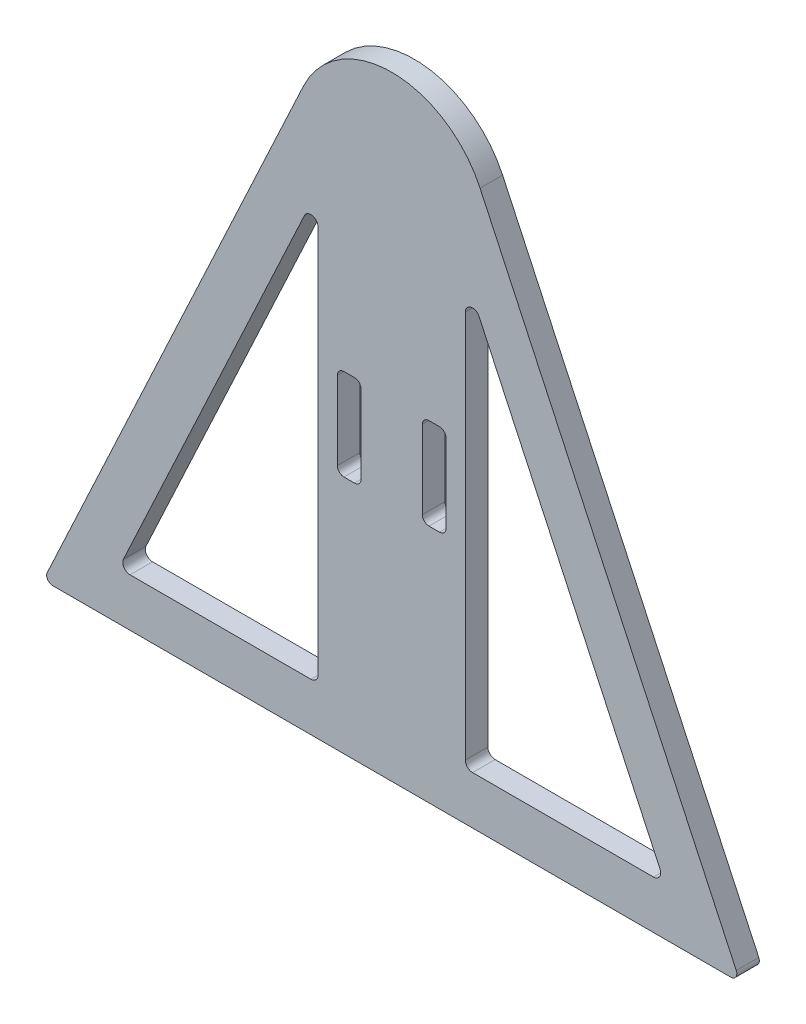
ISO-10303-21;
HEADER;
FILE_DESCRIPTION(('STEP AP214'),'2;1');
FILE_NAME('part.step','',(''),(''),'','','');
FILE_SCHEMA(('AUTOMOTIVE_DESIGN { 1 0 10303 214 1 1 1 1 }'));
ENDSEC;
DATA;
#1=APPLICATION_CONTEXT('core data for automotive mechanical design processes');
#2=APPLICATION_PROTOCOL_DEFINITION('international standard','automotive_design',2000,#1);
#3=PRODUCT_CONTEXT('',#1,'mechanical');
#4=PRODUCT('Part','Part','',(#3));
#5=PRODUCT_RELATED_PRODUCT_CATEGORY('part','',(#4));
#6=PRODUCT_DEFINITION_FORMATION('','',#4);
#7=PRODUCT_DEFINITION_CONTEXT('part definition',#1,'design');
#8=PRODUCT_DEFINITION('design','',#6,#7);
#9=PRODUCT_DEFINITION_SHAPE('','',#8);
#10=(LENGTH_UNIT() NAMED_UNIT(*) SI_UNIT(.MILLI.,.METRE.));
#11=(NAMED_UNIT(*) PLANE_ANGLE_UNIT() SI_UNIT($,.RADIAN.));
#12=(NAMED_UNIT(*) SI_UNIT($,.STERADIAN.) SOLID_ANGLE_UNIT());
#13=UNCERTAINTY_MEASURE_WITH_UNIT(LENGTH_MEASURE(1.E-05),#10,'distance_accuracy_value','');
#14=(GEOMETRIC_REPRESENTATION_CONTEXT(3) GLOBAL_UNCERTAINTY_ASSIGNED_CONTEXT((#13)) GLOBAL_UNIT_ASSIGNED_CONTEXT((#10,
#11,#12)) REPRESENTATION_CONTEXT('',''));
#15=CARTESIAN_POINT('',(0.,0.,0.));
#16=DIRECTION('',(0.,0.,1.));
#17=DIRECTION('',(1.,0.,0.));
#18=AXIS2_PLACEMENT_3D('',#15,#16,#17);
#19=CARTESIAN_POINT('',(-73.66,0.,4.7625));
#20=DIRECTION('',(0.906307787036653,-0.422618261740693,0.));
#21=DIRECTION('',(0.422618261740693,0.906307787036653,0.));
#22=AXIS2_PLACEMENT_3D('',#19,#20,#21);
#23=PLANE('',#22);
#24=DIRECTION('',(-0.422618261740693,-0.906307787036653,0.));
#25=VECTOR('',#24,1.);
#26=CARTESIAN_POINT('',(-73.66,0.,0.));
#27=LINE('',#26,#25);
#28=CARTESIAN_POINT('',(-18.6701806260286,117.926048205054,0.));
#29=VERTEX_POINT('',#28);
#30=CARTESIAN_POINT('',(-72.8175102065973,1.80672519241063,0.));
#31=VERTEX_POINT('',#30);
#32=EDGE_CURVE('E470',#29,#31,#27,.T.);
#33=ORIENTED_EDGE('',*,*,#32,.T.);
#34=DIRECTION('',(0.,0.,-1.));
#35=VECTOR('',#34,1.);
#36=CARTESIAN_POINT('',(-72.8175102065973,1.80672519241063,4.7625));
#37=LINE('',#36,#35);
#38=CARTESIAN_POINT('',(-72.8175102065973,1.80672519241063,4.7625));
#39=VERTEX_POINT('',#38);
#40=EDGE_CURVE('E519',#31,#39,#37,.F.);
#41=ORIENTED_EDGE('',*,*,#40,.T.);
#42=DIRECTION('',(-0.422618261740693,-0.906307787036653,0.));
#43=VECTOR('',#42,1.);
#44=CARTESIAN_POINT('',(-73.66,0.,4.7625));
#45=LINE('',#44,#43);
#46=CARTESIAN_POINT('',(-18.6701806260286,117.926048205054,4.7625));
#47=VERTEX_POINT('',#46);
#48=EDGE_CURVE('E485',#47,#39,#45,.T.);
#49=ORIENTED_EDGE('',*,*,#48,.F.);
#50=DIRECTION('',(0.,0.,-1.));
#51=VECTOR('',#50,1.);
#52=CARTESIAN_POINT('',(-18.6701806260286,117.926048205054,4.7625));
#53=LINE('',#52,#51);
#54=EDGE_CURVE('E496',#47,#29,#53,.T.);
#55=ORIENTED_EDGE('',*,*,#54,.T.);
#56=EDGE_LOOP('',(#33,#41,#49,#55));
#57=FACE_BOUND('',#56,.T.);
#58=ADVANCED_FACE('F35',(#57),#23,.F.);
#59=CARTESIAN_POINT('',(73.66,0.,4.7625));
#60=DIRECTION('',(0.,1.,0.));
#61=DIRECTION('',(-1.,0.,0.));
#62=AXIS2_PLACEMENT_3D('',#59,#60,#61);
#63=PLANE('',#62);
#64=DIRECTION('',(1.,0.,0.));
#65=VECTOR('',#64,1.);
#66=CARTESIAN_POINT('',(73.66,0.,4.7625));
#67=LINE('',#66,#65);
#68=CARTESIAN_POINT('',(-71.6664993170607,0.,4.7625));
#69=VERTEX_POINT('',#68);
#70=CARTESIAN_POINT('',(71.6664993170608,0.,4.7625));
#71=VERTEX_POINT('',#70);
#72=EDGE_CURVE('E488',#69,#71,#67,.T.);
#73=ORIENTED_EDGE('',*,*,#72,.F.);
#74=DIRECTION('',(0.,0.,-1.));
#75=VECTOR('',#74,1.);
#76=CARTESIAN_POINT('',(-71.6664993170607,0.,4.7625));
#77=LINE('',#76,#75);
#78=CARTESIAN_POINT('',(-71.6664993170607,0.,0.));
#79=VERTEX_POINT('',#78);
#80=EDGE_CURVE('E512',#69,#79,#77,.T.);
#81=ORIENTED_EDGE('',*,*,#80,.T.);
#82=DIRECTION('',(1.,0.,0.));
#83=VECTOR('',#82,1.);
#84=CARTESIAN_POINT('',(73.66,0.,0.));
#85=LINE('',#84,#83);
#86=CARTESIAN_POINT('',(71.6664993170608,0.,0.));
#87=VERTEX_POINT('',#86);
#88=EDGE_CURVE('E499',#79,#87,#85,.T.);
#89=ORIENTED_EDGE('',*,*,#88,.T.);
#90=DIRECTION('',(0.,0.,-1.));
#91=VECTOR('',#90,1.);
#92=CARTESIAN_POINT('',(71.6664993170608,0.,4.7625));
#93=LINE('',#92,#91);
#94=EDGE_CURVE('E510',#87,#71,#93,.F.);
#95=ORIENTED_EDGE('',*,*,#94,.T.);
#96=EDGE_LOOP('',(#73,#81,#89,#95));
#97=FACE_BOUND('',#96,.T.);
#98=ADVANCED_FACE('F532',(#97),#63,.F.);
#99=CARTESIAN_POINT('',(73.66,0.,4.7625));
#100=DIRECTION('',(-0.906307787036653,-0.422618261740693,0.));
#101=DIRECTION('',(0.422618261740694,-0.906307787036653,0.));
#102=AXIS2_PLACEMENT_3D('',#99,#100,#101);
#103=PLANE('',#102);
#104=DIRECTION('',(-0.422618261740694,0.906307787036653,0.));
#105=VECTOR('',#104,1.);
#106=CARTESIAN_POINT('',(73.66,0.,4.7625));
#107=LINE('',#106,#105);
#108=CARTESIAN_POINT('',(72.8175102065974,1.80672519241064,4.7625));
#109=VERTEX_POINT('',#108);
#110=CARTESIAN_POINT('',(18.6701806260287,117.926048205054,4.7625));
#111=VERTEX_POINT('',#110);
#112=EDGE_CURVE('E492',#109,#111,#107,.T.);
#113=ORIENTED_EDGE('',*,*,#112,.F.);
#114=DIRECTION('',(0.,0.,-1.));
#115=VECTOR('',#114,1.);
#116=CARTESIAN_POINT('',(72.8175102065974,1.80672519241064,4.7625));
#117=LINE('',#116,#115);
#118=CARTESIAN_POINT('',(72.8175102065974,1.80672519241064,0.));
#119=VERTEX_POINT('',#118);
#120=EDGE_CURVE('E11',#109,#119,#117,.T.);
#121=ORIENTED_EDGE('',*,*,#120,.T.);
#122=DIRECTION('',(-0.422618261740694,0.906307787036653,0.));
#123=VECTOR('',#122,1.);
#124=CARTESIAN_POINT('',(73.66,0.,0.));
#125=LINE('',#124,#123);
#126=CARTESIAN_POINT('',(18.6701806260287,117.926048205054,0.));
#127=VERTEX_POINT('',#126);
#128=EDGE_CURVE('E502',#119,#127,#125,.T.);
#129=ORIENTED_EDGE('',*,*,#128,.T.);
#130=DIRECTION('',(0.,0.,-1.));
#131=VECTOR('',#130,1.);
#132=CARTESIAN_POINT('',(18.6701806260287,117.926048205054,4.7625));
#133=LINE('',#132,#131);
#134=EDGE_CURVE('E507',#111,#127,#133,.T.);
#135=ORIENTED_EDGE('',*,*,#134,.F.);
#136=EDGE_LOOP('',(#113,#121,#129,#135));
#137=FACE_BOUND('',#136,.T.);
#138=ADVANCED_FACE('F548',(#137),#103,.F.);
#139=CARTESIAN_POINT('',(0.,109.22,4.7625));
#140=DIRECTION('',(0.,0.,-1.));
#141=DIRECTION('',(-1.,0.,0.));
#142=AXIS2_PLACEMENT_3D('',#139,#140,#141);
#143=CYLINDRICAL_SURFACE('',#142,20.6002650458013);
#144=CARTESIAN_POINT('',(0.,109.22,0.));
#145=DIRECTION('',(0.,0.,1.));
#146=DIRECTION('',(-1.,0.,0.));
#147=AXIS2_PLACEMENT_3D('',#144,#145,#146);
#148=CIRCLE('',#147,20.6002650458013);
#149=EDGE_CURVE('E489',#127,#29,#148,.T.);
#150=ORIENTED_EDGE('',*,*,#149,.T.);
#151=ORIENTED_EDGE('',*,*,#54,.F.);
#152=CARTESIAN_POINT('',(0.,109.22,4.7625));
#153=DIRECTION('',(0.,0.,1.));
#154=DIRECTION('',(-1.,0.,0.));
#155=AXIS2_PLACEMENT_3D('',#152,#153,#154);
#156=CIRCLE('',#155,20.6002650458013);
#157=EDGE_CURVE('E494',#111,#47,#156,.T.);
#158=ORIENTED_EDGE('',*,*,#157,.F.);
#159=ORIENTED_EDGE('',*,*,#134,.T.);
#160=EDGE_LOOP('',(#150,#151,#158,#159));
#161=FACE_BOUND('',#160,.T.);
#162=ADVANCED_FACE('F543',(#161),#143,.T.);
#163=CARTESIAN_POINT('',(0.,109.22,4.7625));
#164=DIRECTION('',(0.,0.,-1.));
#165=DIRECTION('',(-1.,0.,0.));
#166=AXIS2_PLACEMENT_3D('',#163,#164,#165);
#167=PLANE('',#166);
#168=DIRECTION('',(0.,-1.,0.));
#169=VECTOR('',#168,1.);
#170=CARTESIAN_POINT('',(15.5575,93.686285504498,4.7625));
#171=LINE('',#170,#169);
#172=CARTESIAN_POINT('',(15.5575,93.686285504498,4.7625));
#173=VERTEX_POINT('',#172);
#174=CARTESIAN_POINT('',(15.5575,11.6839999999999,4.7625));
#175=VERTEX_POINT('',#174);
#176=EDGE_CURVE('E289',#173,#175,#171,.T.);
#177=ORIENTED_EDGE('',*,*,#176,.F.);
#178=CARTESIAN_POINT('',(17.0815,93.686285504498,4.7625));
#179=DIRECTION('',(0.,0.,1.));
#180=DIRECTION('',(1.,0.,0.));
#181=AXIS2_PLACEMENT_3D('',#178,#179,#180);
#182=CIRCLE('',#181,1.524);
#183=CARTESIAN_POINT('',(18.4627130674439,94.3303557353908,4.7625));
#184=VERTEX_POINT('',#183);
#185=EDGE_CURVE('E50',#184,#173,#182,.T.);
#186=ORIENTED_EDGE('',*,*,#185,.F.);
#187=DIRECTION('',(-0.422618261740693,0.906307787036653,0.));
#188=VECTOR('',#187,1.);
#189=CARTESIAN_POINT('',(56.7010067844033,12.3280702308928,4.7625));
#190=LINE('',#189,#188);
#191=CARTESIAN_POINT('',(56.7010067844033,12.3280702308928,4.7625));
#192=VERTEX_POINT('',#191);
#193=EDGE_CURVE('E275',#192,#184,#190,.T.);
#194=ORIENTED_EDGE('',*,*,#193,.F.);
#195=CARTESIAN_POINT('',(55.3197937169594,11.6839999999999,4.7625));
#196=DIRECTION('',(0.,0.,1.));
#197=DIRECTION('',(1.,0.,0.));
#198=AXIS2_PLACEMENT_3D('',#195,#196,#197);
#199=CIRCLE('',#198,1.524);
#200=CARTESIAN_POINT('',(55.3197937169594,10.1599999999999,4.7625));
#201=VERTEX_POINT('',#200);
#202=EDGE_CURVE('E278',#201,#192,#199,.T.);
#203=ORIENTED_EDGE('',*,*,#202,.F.);
#204=DIRECTION('',(1.,0.,0.));
#205=VECTOR('',#204,1.);
#206=CARTESIAN_POINT('',(17.0815,10.1599999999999,4.7625));
#207=LINE('',#206,#205);
#208=CARTESIAN_POINT('',(17.0815,10.1599999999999,4.7625));
#209=VERTEX_POINT('',#208);
#210=EDGE_CURVE('E294',#209,#201,#207,.T.);
#211=ORIENTED_EDGE('',*,*,#210,.F.);
#212=CARTESIAN_POINT('',(17.0815,11.6839999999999,4.7625));
#213=DIRECTION('',(0.,0.,1.));
#214=DIRECTION('',(-1.,0.,0.));
#215=AXIS2_PLACEMENT_3D('',#212,#213,#214);
#216=CIRCLE('',#215,1.524);
#217=EDGE_CURVE('E291',#175,#209,#216,.T.);
#218=ORIENTED_EDGE('',*,*,#217,.F.);
#219=EDGE_LOOP('',(#177,#186,#194,#203,#211,#218));
#220=FACE_BOUND('',#219,.T.);
#221=DIRECTION('',(0.,1.,0.));
#222=VECTOR('',#221,1.);
#223=CARTESIAN_POINT('',(-15.5575,93.686285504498,4.7625));
#224=LINE('',#223,#222);
#225=CARTESIAN_POINT('',(-15.5575,11.6839999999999,4.7625));
#226=VERTEX_POINT('',#225);
#227=CARTESIAN_POINT('',(-15.5575,93.686285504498,4.7625));
#228=VERTEX_POINT('',#227);
#229=EDGE_CURVE('E330',#226,#228,#224,.T.);
#230=ORIENTED_EDGE('',*,*,#229,.F.);
#231=CARTESIAN_POINT('',(-17.0815,11.6839999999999,4.7625));
#232=DIRECTION('',(0.,0.,1.));
#233=DIRECTION('',(1.,0.,0.));
#234=AXIS2_PLACEMENT_3D('',#231,#232,#233);
#235=CIRCLE('',#234,1.524);
#236=CARTESIAN_POINT('',(-17.0815,10.1599999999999,4.7625));
#237=VERTEX_POINT('',#236);
#238=EDGE_CURVE('E301',#237,#226,#235,.T.);
#239=ORIENTED_EDGE('',*,*,#238,.F.);
#240=DIRECTION('',(1.,0.,0.));
#241=VECTOR('',#240,1.);
#242=CARTESIAN_POINT('',(-17.0815,10.1599999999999,4.7625));
#243=LINE('',#242,#241);
#244=CARTESIAN_POINT('',(-55.3197937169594,10.1599999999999,4.7625));
#245=VERTEX_POINT('',#244);
#246=EDGE_CURVE('E313',#245,#237,#243,.T.);
#247=ORIENTED_EDGE('',*,*,#246,.F.);
#248=CARTESIAN_POINT('',(-55.3197937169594,11.6839999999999,4.7625));
#249=DIRECTION('',(0.,0.,1.));
#250=DIRECTION('',(-1.,0.,0.));
#251=AXIS2_PLACEMENT_3D('',#248,#249,#250);
#252=CIRCLE('',#251,1.524);
#253=CARTESIAN_POINT('',(-56.7010067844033,12.3280702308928,4.7625));
#254=VERTEX_POINT('',#253);
#255=EDGE_CURVE('E339',#254,#245,#252,.T.);
#256=ORIENTED_EDGE('',*,*,#255,.F.);
#257=DIRECTION('',(-0.422618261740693,-0.906307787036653,0.));
#258=VECTOR('',#257,1.);
#259=CARTESIAN_POINT('',(-56.7010067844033,12.3280702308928,4.7625));
#260=LINE('',#259,#258);
#261=CARTESIAN_POINT('',(-18.4627130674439,94.3303557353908,4.7625));
#262=VERTEX_POINT('',#261);
#263=EDGE_CURVE('E336',#262,#254,#260,.T.);
#264=ORIENTED_EDGE('',*,*,#263,.F.);
#265=CARTESIAN_POINT('',(-17.0815,93.686285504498,4.7625));
#266=DIRECTION('',(0.,0.,1.));
#267=DIRECTION('',(-1.,0.,0.));
#268=AXIS2_PLACEMENT_3D('',#265,#266,#267);
#269=CIRCLE('',#268,1.524);
#270=EDGE_CURVE('E333',#228,#262,#269,.T.);
#271=ORIENTED_EDGE('',*,*,#270,.F.);
#272=EDGE_LOOP('',(#230,#239,#247,#256,#264,#271));
#273=FACE_BOUND('',#272,.T.);
#274=DIRECTION('',(0.,-1.,0.));
#275=VECTOR('',#274,1.);
#276=CARTESIAN_POINT('',(6.47700000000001,68.58,4.7625));
#277=LINE('',#276,#275);
#278=CARTESIAN_POINT('',(6.47700000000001,68.58,4.7625));
#279=VERTEX_POINT('',#278);
#280=CARTESIAN_POINT('',(6.477,52.07,4.7625));
#281=VERTEX_POINT('',#280);
#282=EDGE_CURVE('E384',#279,#281,#277,.T.);
#283=ORIENTED_EDGE('',*,*,#282,.F.);
#284=CARTESIAN_POINT('',(7.874,68.58,4.7625));
#285=DIRECTION('',(0.,0.,1.));
#286=DIRECTION('',(1.,0.,0.));
#287=AXIS2_PLACEMENT_3D('',#284,#285,#286);
#288=CIRCLE('',#287,1.39699999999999);
#289=CARTESIAN_POINT('',(7.874,69.977,4.7625));
#290=VERTEX_POINT('',#289);
#291=EDGE_CURVE('E346',#290,#279,#288,.T.);
#292=ORIENTED_EDGE('',*,*,#291,.F.);
#293=DIRECTION('',(-1.,0.,0.));
#294=VECTOR('',#293,1.);
#295=CARTESIAN_POINT('',(10.0965,69.977,4.7625));
#296=LINE('',#295,#294);
#297=CARTESIAN_POINT('',(10.0965,69.977,4.7625));
#298=VERTEX_POINT('',#297);
#299=EDGE_CURVE('E361',#298,#290,#296,.T.);
#300=ORIENTED_EDGE('',*,*,#299,.F.);
#301=CARTESIAN_POINT('',(10.0965,68.58,4.7625));
#302=DIRECTION('',(0.,0.,1.));
#303=DIRECTION('',(1.,0.,0.));
#304=AXIS2_PLACEMENT_3D('',#301,#302,#303);
#305=CIRCLE('',#304,1.397);
#306=CARTESIAN_POINT('',(11.4935,68.58,4.7625));
#307=VERTEX_POINT('',#306);
#308=EDGE_CURVE('E399',#307,#298,#305,.T.);
#309=ORIENTED_EDGE('',*,*,#308,.F.);
#310=DIRECTION('',(0.,1.,0.));
#311=VECTOR('',#310,1.);
#312=CARTESIAN_POINT('',(11.4935,52.07,4.7625));
#313=LINE('',#312,#311);
#314=CARTESIAN_POINT('',(11.4935,52.07,4.7625));
#315=VERTEX_POINT('',#314);
#316=EDGE_CURVE('E396',#315,#307,#313,.T.);
#317=ORIENTED_EDGE('',*,*,#316,.F.);
#318=CARTESIAN_POINT('',(10.0965,52.07,4.7625));
#319=DIRECTION('',(0.,0.,1.));
#320=DIRECTION('',(1.,0.,0.));
#321=AXIS2_PLACEMENT_3D('',#318,#319,#320);
#322=CIRCLE('',#321,1.397);
#323=CARTESIAN_POINT('',(10.0965,50.673,4.7625));
#324=VERTEX_POINT('',#323);
#325=EDGE_CURVE('E393',#324,#315,#322,.T.);
#326=ORIENTED_EDGE('',*,*,#325,.F.);
#327=DIRECTION('',(1.,0.,0.));
#328=VECTOR('',#327,1.);
#329=CARTESIAN_POINT('',(7.874,50.673,4.7625));
#330=LINE('',#329,#328);
#331=CARTESIAN_POINT('',(7.874,50.673,4.7625));
#332=VERTEX_POINT('',#331);
#333=EDGE_CURVE('E390',#332,#324,#330,.T.);
#334=ORIENTED_EDGE('',*,*,#333,.F.);
#335=CARTESIAN_POINT('',(7.874,52.07,4.7625));
#336=DIRECTION('',(0.,0.,1.));
#337=DIRECTION('',(1.,0.,0.));
#338=AXIS2_PLACEMENT_3D('',#335,#336,#337);
#339=CIRCLE('',#338,1.397);
#340=EDGE_CURVE('E387',#281,#332,#339,.T.);
#341=ORIENTED_EDGE('',*,*,#340,.F.);
#342=EDGE_LOOP('',(#283,#292,#300,#309,#317,#326,#334,#341));
#343=FACE_BOUND('',#342,.T.);
#344=DIRECTION('',(0.,-1.,0.));
#345=VECTOR('',#344,1.);
#346=CARTESIAN_POINT('',(-11.4935,52.07,4.7625));
#347=LINE('',#346,#345);
#348=CARTESIAN_POINT('',(-11.4935,68.58,4.7625));
#349=VERTEX_POINT('',#348);
#350=CARTESIAN_POINT('',(-11.4935,52.07,4.7625));
#351=VERTEX_POINT('',#350);
#352=EDGE_CURVE('E448',#349,#351,#347,.T.);
#353=ORIENTED_EDGE('',*,*,#352,.F.);
#354=CARTESIAN_POINT('',(-10.0965,68.58,4.7625));
#355=DIRECTION('',(0.,0.,1.));
#356=DIRECTION('',(-1.,0.,0.));
#357=AXIS2_PLACEMENT_3D('',#354,#355,#356);
#358=CIRCLE('',#357,1.397);
#359=CARTESIAN_POINT('',(-10.0965,69.977,4.7625));
#360=VERTEX_POINT('',#359);
#361=EDGE_CURVE('E406',#360,#349,#358,.T.);
#362=ORIENTED_EDGE('',*,*,#361,.F.);
#363=DIRECTION('',(-1.,0.,0.));
#364=VECTOR('',#363,1.);
#365=CARTESIAN_POINT('',(-10.0965,69.977,4.7625));
#366=LINE('',#365,#364);
#367=CARTESIAN_POINT('',(-7.874,69.977,4.7625));
#368=VERTEX_POINT('',#367);
#369=EDGE_CURVE('E425',#368,#360,#366,.T.);
#370=ORIENTED_EDGE('',*,*,#369,.F.);
#371=CARTESIAN_POINT('',(-7.874,68.58,4.7625));
#372=DIRECTION('',(0.,0.,1.));
#373=DIRECTION('',(-1.,0.,0.));
#374=AXIS2_PLACEMENT_3D('',#371,#372,#373);
#375=CIRCLE('',#374,1.39699999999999);
#376=CARTESIAN_POINT('',(-6.47700000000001,68.58,4.7625));
#377=VERTEX_POINT('',#376);
#378=EDGE_CURVE('E463',#377,#368,#375,.T.);
#379=ORIENTED_EDGE('',*,*,#378,.F.);
#380=DIRECTION('',(0.,1.,0.));
#381=VECTOR('',#380,1.);
#382=CARTESIAN_POINT('',(-6.47700000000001,68.58,4.7625));
#383=LINE('',#382,#381);
#384=CARTESIAN_POINT('',(-6.477,52.07,4.7625));
#385=VERTEX_POINT('',#384);
#386=EDGE_CURVE('E460',#385,#377,#383,.T.);
#387=ORIENTED_EDGE('',*,*,#386,.F.);
#388=CARTESIAN_POINT('',(-7.874,52.07,4.7625));
#389=DIRECTION('',(0.,0.,1.));
#390=DIRECTION('',(-1.,0.,0.));
#391=AXIS2_PLACEMENT_3D('',#388,#389,#390);
#392=CIRCLE('',#391,1.397);
#393=CARTESIAN_POINT('',(-7.874,50.673,4.7625));
#394=VERTEX_POINT('',#393);
#395=EDGE_CURVE('E457',#394,#385,#392,.T.);
#396=ORIENTED_EDGE('',*,*,#395,.F.);
#397=DIRECTION('',(1.,0.,0.));
#398=VECTOR('',#397,1.);
#399=CARTESIAN_POINT('',(-7.874,50.673,4.7625));
#400=LINE('',#399,#398);
#401=CARTESIAN_POINT('',(-10.0965,50.673,4.7625));
#402=VERTEX_POINT('',#401);
#403=EDGE_CURVE('E454',#402,#394,#400,.T.);
#404=ORIENTED_EDGE('',*,*,#403,.F.);
#405=CARTESIAN_POINT('',(-10.0965,52.07,4.7625));
#406=DIRECTION('',(0.,0.,1.));
#407=DIRECTION('',(-1.,0.,0.));
#408=AXIS2_PLACEMENT_3D('',#405,#406,#407);
#409=CIRCLE('',#408,1.397);
#410=EDGE_CURVE('E451',#351,#402,#409,.T.);
#411=ORIENTED_EDGE('',*,*,#410,.F.);
#412=EDGE_LOOP('',(#353,#362,#370,#379,#387,#396,#404,#411));
#413=FACE_BOUND('',#412,.T.);
#414=ORIENTED_EDGE('',*,*,#48,.T.);
#415=CARTESIAN_POINT('',(-71.6664993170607,1.26999999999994,4.7625));
#416=DIRECTION('',(0.,0.,-1.));
#417=DIRECTION('',(-1.,0.,0.));
#418=AXIS2_PLACEMENT_3D('',#415,#416,#417);
#419=CIRCLE('',#418,1.27);
#420=EDGE_CURVE('E43',#39,#69,#419,.F.);
#421=ORIENTED_EDGE('',*,*,#420,.T.);
#422=ORIENTED_EDGE('',*,*,#72,.T.);
#423=CARTESIAN_POINT('',(71.6664993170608,1.26999999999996,4.7625));
#424=DIRECTION('',(0.,0.,-1.));
#425=DIRECTION('',(-1.,0.,0.));
#426=AXIS2_PLACEMENT_3D('',#423,#424,#425);
#427=CIRCLE('',#426,1.27);
#428=EDGE_CURVE('E521',#71,#109,#427,.F.);
#429=ORIENTED_EDGE('',*,*,#428,.T.);
#430=ORIENTED_EDGE('',*,*,#112,.T.);
#431=ORIENTED_EDGE('',*,*,#157,.T.);
#432=EDGE_LOOP('',(#414,#421,#422,#429,#430,#431));
#433=FACE_BOUND('',#432,.T.);
#434=ADVANCED_FACE('F525',(#220,#273,#343,#413,#433),#167,.F.);
#435=CARTESIAN_POINT('',(0.,109.22,0.));
#436=DIRECTION('',(0.,0.,-1.));
#437=DIRECTION('',(-1.,0.,0.));
#438=AXIS2_PLACEMENT_3D('',#435,#436,#437);
#439=PLANE('',#438);
#440=CARTESIAN_POINT('',(17.0815,93.686285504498,0.));
#441=DIRECTION('',(0.,0.,1.));
#442=DIRECTION('',(1.,0.,0.));
#443=AXIS2_PLACEMENT_3D('',#440,#441,#442);
#444=CIRCLE('',#443,1.524);
#445=CARTESIAN_POINT('',(18.4627130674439,94.3303557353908,0.));
#446=VERTEX_POINT('',#445);
#447=CARTESIAN_POINT('',(15.5575,93.686285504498,0.));
#448=VERTEX_POINT('',#447);
#449=EDGE_CURVE('E258',#446,#448,#444,.T.);
#450=ORIENTED_EDGE('',*,*,#449,.T.);
#451=DIRECTION('',(0.,-1.,0.));
#452=VECTOR('',#451,1.);
#453=CARTESIAN_POINT('',(15.5575,93.686285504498,0.));
#454=LINE('',#453,#452);
#455=CARTESIAN_POINT('',(15.5575,11.6839999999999,0.));
#456=VERTEX_POINT('',#455);
#457=EDGE_CURVE('E267',#448,#456,#454,.T.);
#458=ORIENTED_EDGE('',*,*,#457,.T.);
#459=CARTESIAN_POINT('',(17.0815,11.6839999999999,0.));
#460=DIRECTION('',(0.,0.,1.));
#461=DIRECTION('',(-1.,0.,0.));
#462=AXIS2_PLACEMENT_3D('',#459,#460,#461);
#463=CIRCLE('',#462,1.524);
#464=CARTESIAN_POINT('',(17.0815,10.1599999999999,0.));
#465=VERTEX_POINT('',#464);
#466=EDGE_CURVE('E58',#456,#465,#463,.T.);
#467=ORIENTED_EDGE('',*,*,#466,.T.);
#468=DIRECTION('',(1.,0.,0.));
#469=VECTOR('',#468,1.);
#470=CARTESIAN_POINT('',(17.0815,10.1599999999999,0.));
#471=LINE('',#470,#469);
#472=CARTESIAN_POINT('',(55.3197937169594,10.1599999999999,0.));
#473=VERTEX_POINT('',#472);
#474=EDGE_CURVE('E282',#465,#473,#471,.T.);
#475=ORIENTED_EDGE('',*,*,#474,.T.);
#476=CARTESIAN_POINT('',(55.3197937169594,11.6839999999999,0.));
#477=DIRECTION('',(0.,0.,1.));
#478=DIRECTION('',(1.,0.,0.));
#479=AXIS2_PLACEMENT_3D('',#476,#477,#478);
#480=CIRCLE('',#479,1.524);
#481=CARTESIAN_POINT('',(56.7010067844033,12.3280702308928,0.));
#482=VERTEX_POINT('',#481);
#483=EDGE_CURVE('E285',#473,#482,#480,.T.);
#484=ORIENTED_EDGE('',*,*,#483,.T.);
#485=DIRECTION('',(-0.422618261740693,0.906307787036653,0.));
#486=VECTOR('',#485,1.);
#487=CARTESIAN_POINT('',(56.7010067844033,12.3280702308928,0.));
#488=LINE('',#487,#486);
#489=EDGE_CURVE('E264',#482,#446,#488,.T.);
#490=ORIENTED_EDGE('',*,*,#489,.T.);
#491=EDGE_LOOP('',(#450,#458,#467,#475,#484,#490));
#492=FACE_BOUND('',#491,.T.);
#493=CARTESIAN_POINT('',(-17.0815,11.6839999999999,0.));
#494=DIRECTION('',(0.,0.,1.));
#495=DIRECTION('',(1.,0.,0.));
#496=AXIS2_PLACEMENT_3D('',#493,#494,#495);
#497=CIRCLE('',#496,1.524);
#498=CARTESIAN_POINT('',(-17.0815,10.1599999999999,0.));
#499=VERTEX_POINT('',#498);
#500=CARTESIAN_POINT('',(-15.5575,11.6839999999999,0.));
#501=VERTEX_POINT('',#500);
#502=EDGE_CURVE('E309',#499,#501,#497,.T.);
#503=ORIENTED_EDGE('',*,*,#502,.T.);
#504=DIRECTION('',(0.,1.,0.));
#505=VECTOR('',#504,1.);
#506=CARTESIAN_POINT('',(-15.5575,93.686285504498,0.));
#507=LINE('',#506,#505);
#508=CARTESIAN_POINT('',(-15.5575,93.686285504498,0.));
#509=VERTEX_POINT('',#508);
#510=EDGE_CURVE('E312',#501,#509,#507,.T.);
#511=ORIENTED_EDGE('',*,*,#510,.T.);
#512=CARTESIAN_POINT('',(-17.0815,93.686285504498,0.));
#513=DIRECTION('',(0.,0.,1.));
#514=DIRECTION('',(-1.,0.,0.));
#515=AXIS2_PLACEMENT_3D('',#512,#513,#514);
#516=CIRCLE('',#515,1.524);
#517=CARTESIAN_POINT('',(-18.4627130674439,94.3303557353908,0.));
#518=VERTEX_POINT('',#517);
#519=EDGE_CURVE('E316',#509,#518,#516,.T.);
#520=ORIENTED_EDGE('',*,*,#519,.T.);
#521=DIRECTION('',(-0.422618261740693,-0.906307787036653,0.));
#522=VECTOR('',#521,1.);
#523=CARTESIAN_POINT('',(-56.7010067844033,12.3280702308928,0.));
#524=LINE('',#523,#522);
#525=CARTESIAN_POINT('',(-56.7010067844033,12.3280702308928,0.));
#526=VERTEX_POINT('',#525);
#527=EDGE_CURVE('E319',#518,#526,#524,.T.);
#528=ORIENTED_EDGE('',*,*,#527,.T.);
#529=CARTESIAN_POINT('',(-55.3197937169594,11.6839999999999,0.));
#530=DIRECTION('',(0.,0.,1.));
#531=DIRECTION('',(-1.,0.,0.));
#532=AXIS2_PLACEMENT_3D('',#529,#530,#531);
#533=CIRCLE('',#532,1.524);
#534=CARTESIAN_POINT('',(-55.3197937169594,10.1599999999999,0.));
#535=VERTEX_POINT('',#534);
#536=EDGE_CURVE('E322',#526,#535,#533,.T.);
#537=ORIENTED_EDGE('',*,*,#536,.T.);
#538=DIRECTION('',(1.,0.,0.));
#539=VECTOR('',#538,1.);
#540=CARTESIAN_POINT('',(-17.0815,10.1599999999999,0.));
#541=LINE('',#540,#539);
#542=EDGE_CURVE('E325',#535,#499,#541,.T.);
#543=ORIENTED_EDGE('',*,*,#542,.T.);
#544=EDGE_LOOP('',(#503,#511,#520,#528,#537,#543));
#545=FACE_BOUND('',#544,.T.);
#546=CARTESIAN_POINT('',(7.874,68.58,0.));
#547=DIRECTION('',(0.,0.,1.));
#548=DIRECTION('',(1.,0.,0.));
#549=AXIS2_PLACEMENT_3D('',#546,#547,#548);
#550=CIRCLE('',#549,1.39699999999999);
#551=CARTESIAN_POINT('',(7.874,69.977,0.));
#552=VERTEX_POINT('',#551);
#553=CARTESIAN_POINT('',(6.47700000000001,68.58,0.));
#554=VERTEX_POINT('',#553);
#555=EDGE_CURVE('E357',#552,#554,#550,.T.);
#556=ORIENTED_EDGE('',*,*,#555,.T.);
#557=DIRECTION('',(0.,-1.,0.));
#558=VECTOR('',#557,1.);
#559=CARTESIAN_POINT('',(6.47700000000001,68.58,0.));
#560=LINE('',#559,#558);
#561=CARTESIAN_POINT('',(6.477,52.07,0.));
#562=VERTEX_POINT('',#561);
#563=EDGE_CURVE('E360',#554,#562,#560,.T.);
#564=ORIENTED_EDGE('',*,*,#563,.T.);
#565=CARTESIAN_POINT('',(7.874,52.07,0.));
#566=DIRECTION('',(0.,0.,1.));
#567=DIRECTION('',(1.,0.,0.));
#568=AXIS2_PLACEMENT_3D('',#565,#566,#567);
#569=CIRCLE('',#568,1.397);
#570=CARTESIAN_POINT('',(7.874,50.673,0.));
#571=VERTEX_POINT('',#570);
#572=EDGE_CURVE('E364',#562,#571,#569,.T.);
#573=ORIENTED_EDGE('',*,*,#572,.T.);
#574=DIRECTION('',(1.,0.,0.));
#575=VECTOR('',#574,1.);
#576=CARTESIAN_POINT('',(7.874,50.673,0.));
#577=LINE('',#576,#575);
#578=CARTESIAN_POINT('',(10.0965,50.673,0.));
#579=VERTEX_POINT('',#578);
#580=EDGE_CURVE('E367',#571,#579,#577,.T.);
#581=ORIENTED_EDGE('',*,*,#580,.T.);
#582=CARTESIAN_POINT('',(10.0965,52.07,0.));
#583=DIRECTION('',(0.,0.,1.));
#584=DIRECTION('',(1.,0.,0.));
#585=AXIS2_PLACEMENT_3D('',#582,#583,#584);
#586=CIRCLE('',#585,1.397);
#587=CARTESIAN_POINT('',(11.4935,52.07,0.));
#588=VERTEX_POINT('',#587);
#589=EDGE_CURVE('E370',#579,#588,#586,.T.);
#590=ORIENTED_EDGE('',*,*,#589,.T.);
#591=DIRECTION('',(0.,1.,0.));
#592=VECTOR('',#591,1.);
#593=CARTESIAN_POINT('',(11.4935,52.07,0.));
#594=LINE('',#593,#592);
#595=CARTESIAN_POINT('',(11.4935,68.58,0.));
#596=VERTEX_POINT('',#595);
#597=EDGE_CURVE('E373',#588,#596,#594,.T.);
#598=ORIENTED_EDGE('',*,*,#597,.T.);
#599=CARTESIAN_POINT('',(10.0965,68.58,0.));
#600=DIRECTION('',(0.,0.,1.));
#601=DIRECTION('',(1.,0.,0.));
#602=AXIS2_PLACEMENT_3D('',#599,#600,#601);
#603=CIRCLE('',#602,1.397);
#604=CARTESIAN_POINT('',(10.0965,69.977,0.));
#605=VERTEX_POINT('',#604);
#606=EDGE_CURVE('E376',#596,#605,#603,.T.);
#607=ORIENTED_EDGE('',*,*,#606,.T.);
#608=DIRECTION('',(-1.,0.,0.));
#609=VECTOR('',#608,1.);
#610=CARTESIAN_POINT('',(10.0965,69.977,0.));
#611=LINE('',#610,#609);
#612=EDGE_CURVE('E379',#605,#552,#611,.T.);
#613=ORIENTED_EDGE('',*,*,#612,.T.);
#614=EDGE_LOOP('',(#556,#564,#573,#581,#590,#598,#607,#613));
#615=FACE_BOUND('',#614,.T.);
#616=CARTESIAN_POINT('',(-10.0965,68.58,0.));
#617=DIRECTION('',(0.,0.,1.));
#618=DIRECTION('',(-1.,0.,0.));
#619=AXIS2_PLACEMENT_3D('',#616,#617,#618);
#620=CIRCLE('',#619,1.397);
#621=CARTESIAN_POINT('',(-10.0965,69.977,0.));
#622=VERTEX_POINT('',#621);
#623=CARTESIAN_POINT('',(-11.4935,68.58,0.));
#624=VERTEX_POINT('',#623);
#625=EDGE_CURVE('E421',#622,#624,#620,.T.);
#626=ORIENTED_EDGE('',*,*,#625,.T.);
#627=DIRECTION('',(0.,-1.,0.));
#628=VECTOR('',#627,1.);
#629=CARTESIAN_POINT('',(-11.4935,52.07,0.));
#630=LINE('',#629,#628);
#631=CARTESIAN_POINT('',(-11.4935,52.07,0.));
#632=VERTEX_POINT('',#631);
#633=EDGE_CURVE('E424',#624,#632,#630,.T.);
#634=ORIENTED_EDGE('',*,*,#633,.T.);
#635=CARTESIAN_POINT('',(-10.0965,52.07,0.));
#636=DIRECTION('',(0.,0.,1.));
#637=DIRECTION('',(-1.,0.,0.));
#638=AXIS2_PLACEMENT_3D('',#635,#636,#637);
#639=CIRCLE('',#638,1.397);
#640=CARTESIAN_POINT('',(-10.0965,50.673,0.));
#641=VERTEX_POINT('',#640);
#642=EDGE_CURVE('E428',#632,#641,#639,.T.);
#643=ORIENTED_EDGE('',*,*,#642,.T.);
#644=DIRECTION('',(1.,0.,0.));
#645=VECTOR('',#644,1.);
#646=CARTESIAN_POINT('',(-7.874,50.673,0.));
#647=LINE('',#646,#645);
#648=CARTESIAN_POINT('',(-7.874,50.673,0.));
#649=VERTEX_POINT('',#648);
#650=EDGE_CURVE('E431',#641,#649,#647,.T.);
#651=ORIENTED_EDGE('',*,*,#650,.T.);
#652=CARTESIAN_POINT('',(-7.874,52.07,0.));
#653=DIRECTION('',(0.,0.,1.));
#654=DIRECTION('',(-1.,0.,0.));
#655=AXIS2_PLACEMENT_3D('',#652,#653,#654);
#656=CIRCLE('',#655,1.397);
#657=CARTESIAN_POINT('',(-6.477,52.07,0.));
#658=VERTEX_POINT('',#657);
#659=EDGE_CURVE('E434',#649,#658,#656,.T.);
#660=ORIENTED_EDGE('',*,*,#659,.T.);
#661=DIRECTION('',(0.,1.,0.));
#662=VECTOR('',#661,1.);
#663=CARTESIAN_POINT('',(-6.47700000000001,68.58,0.));
#664=LINE('',#663,#662);
#665=CARTESIAN_POINT('',(-6.47700000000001,68.58,0.));
#666=VERTEX_POINT('',#665);
#667=EDGE_CURVE('E437',#658,#666,#664,.T.);
#668=ORIENTED_EDGE('',*,*,#667,.T.);
#669=CARTESIAN_POINT('',(-7.874,68.58,0.));
#670=DIRECTION('',(0.,0.,1.));
#671=DIRECTION('',(-1.,0.,0.));
#672=AXIS2_PLACEMENT_3D('',#669,#670,#671);
#673=CIRCLE('',#672,1.39699999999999);
#674=CARTESIAN_POINT('',(-7.874,69.977,0.));
#675=VERTEX_POINT('',#674);
#676=EDGE_CURVE('E440',#666,#675,#673,.T.);
#677=ORIENTED_EDGE('',*,*,#676,.T.);
#678=DIRECTION('',(-1.,0.,0.));
#679=VECTOR('',#678,1.);
#680=CARTESIAN_POINT('',(-10.0965,69.977,0.));
#681=LINE('',#680,#679);
#682=EDGE_CURVE('E443',#675,#622,#681,.T.);
#683=ORIENTED_EDGE('',*,*,#682,.T.);
#684=EDGE_LOOP('',(#626,#634,#643,#651,#660,#668,#677,#683));
#685=FACE_BOUND('',#684,.T.);
#686=ORIENTED_EDGE('',*,*,#88,.F.);
#687=CARTESIAN_POINT('',(-71.6664993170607,1.26999999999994,0.));
#688=DIRECTION('',(0.,0.,-1.));
#689=DIRECTION('',(-1.,0.,0.));
#690=AXIS2_PLACEMENT_3D('',#687,#688,#689);
#691=CIRCLE('',#690,1.27);
#692=EDGE_CURVE('E517',#79,#31,#691,.T.);
#693=ORIENTED_EDGE('',*,*,#692,.T.);
#694=ORIENTED_EDGE('',*,*,#32,.F.);
#695=ORIENTED_EDGE('',*,*,#149,.F.);
#696=ORIENTED_EDGE('',*,*,#128,.F.);
#697=CARTESIAN_POINT('',(71.6664993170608,1.26999999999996,0.));
#698=DIRECTION('',(0.,0.,-1.));
#699=DIRECTION('',(-1.,0.,0.));
#700=AXIS2_PLACEMENT_3D('',#697,#698,#699);
#701=CIRCLE('',#700,1.27);
#702=EDGE_CURVE('E515',#119,#87,#701,.T.);
#703=ORIENTED_EDGE('',*,*,#702,.T.);
#704=EDGE_LOOP('',(#686,#693,#694,#695,#696,#703));
#705=FACE_BOUND('',#704,.T.);
#706=ADVANCED_FACE('F271',(#492,#545,#615,#685,#705),#439,.T.);
#707=CARTESIAN_POINT('',(-10.0965,68.58,0.));
#708=DIRECTION('',(0.,0.,1.));
#709=DIRECTION('',(1.,0.,0.));
#710=AXIS2_PLACEMENT_3D('',#707,#708,#709);
#711=CYLINDRICAL_SURFACE('',#710,1.397);
#712=ORIENTED_EDGE('',*,*,#361,.T.);
#713=DIRECTION('',(0.,0.,1.));
#714=VECTOR('',#713,1.);
#715=CARTESIAN_POINT('',(-11.4935,68.58,0.));
#716=LINE('',#715,#714);
#717=EDGE_CURVE('E446',#624,#349,#716,.T.);
#718=ORIENTED_EDGE('',*,*,#717,.F.);
#719=ORIENTED_EDGE('',*,*,#625,.F.);
#720=DIRECTION('',(0.,0.,1.));
#721=VECTOR('',#720,1.);
#722=CARTESIAN_POINT('',(-10.0965,69.977,0.));
#723=LINE('',#722,#721);
#724=EDGE_CURVE('E468',#622,#360,#723,.T.);
#725=ORIENTED_EDGE('',*,*,#724,.T.);
#726=EDGE_LOOP('',(#712,#718,#719,#725));
#727=FACE_BOUND('',#726,.T.);
#728=ADVANCED_FACE('F574',(#727),#711,.F.);
#729=CARTESIAN_POINT('',(-10.0965,69.977,0.));
#730=DIRECTION('',(0.,1.,0.));
#731=DIRECTION('',(0.,0.,1.));
#732=AXIS2_PLACEMENT_3D('',#729,#730,#731);
#733=PLANE('',#732);
#734=ORIENTED_EDGE('',*,*,#369,.T.);
#735=ORIENTED_EDGE('',*,*,#724,.F.);
#736=ORIENTED_EDGE('',*,*,#682,.F.);
#737=DIRECTION('',(0.,0.,1.));
#738=VECTOR('',#737,1.);
#739=CARTESIAN_POINT('',(-7.874,69.977,0.));
#740=LINE('',#739,#738);
#741=EDGE_CURVE('E471',#675,#368,#740,.T.);
#742=ORIENTED_EDGE('',*,*,#741,.T.);
#743=EDGE_LOOP('',(#734,#735,#736,#742));
#744=FACE_BOUND('',#743,.T.);
#745=ADVANCED_FACE('F580',(#744),#733,.F.);
#746=CARTESIAN_POINT('',(-7.874,68.58,0.));
#747=DIRECTION('',(0.,0.,1.));
#748=DIRECTION('',(1.,0.,0.));
#749=AXIS2_PLACEMENT_3D('',#746,#747,#748);
#750=CYLINDRICAL_SURFACE('',#749,1.39699999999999);
#751=ORIENTED_EDGE('',*,*,#378,.T.);
#752=ORIENTED_EDGE('',*,*,#741,.F.);
#753=ORIENTED_EDGE('',*,*,#676,.F.);
#754=DIRECTION('',(0.,0.,1.));
#755=VECTOR('',#754,1.);
#756=CARTESIAN_POINT('',(-6.47700000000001,68.58,0.));
#757=LINE('',#756,#755);
#758=EDGE_CURVE('E473',#666,#377,#757,.T.);
#759=ORIENTED_EDGE('',*,*,#758,.T.);
#760=EDGE_LOOP('',(#751,#752,#753,#759));
#761=FACE_BOUND('',#760,.T.);
#762=ADVANCED_FACE('F602',(#761),#750,.F.);
#763=CARTESIAN_POINT('',(-6.47700000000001,68.58,0.));
#764=DIRECTION('',(1.,0.,0.));
#765=DIRECTION('',(0.,1.,0.));
#766=AXIS2_PLACEMENT_3D('',#763,#764,#765);
#767=PLANE('',#766);
#768=ORIENTED_EDGE('',*,*,#386,.T.);
#769=ORIENTED_EDGE('',*,*,#758,.F.);
#770=ORIENTED_EDGE('',*,*,#667,.F.);
#771=DIRECTION('',(0.,0.,1.));
#772=VECTOR('',#771,1.);
#773=CARTESIAN_POINT('',(-6.477,52.07,0.));
#774=LINE('',#773,#772);
#775=EDGE_CURVE('E475',#658,#385,#774,.T.);
#776=ORIENTED_EDGE('',*,*,#775,.T.);
#777=EDGE_LOOP('',(#768,#769,#770,#776));
#778=FACE_BOUND('',#777,.T.);
#779=ADVANCED_FACE('F598',(#778),#767,.F.);
#780=CARTESIAN_POINT('',(-7.874,52.07,0.));
#781=DIRECTION('',(0.,0.,1.));
#782=DIRECTION('',(1.,0.,0.));
#783=AXIS2_PLACEMENT_3D('',#780,#781,#782);
#784=CYLINDRICAL_SURFACE('',#783,1.397);
#785=ORIENTED_EDGE('',*,*,#395,.T.);
#786=ORIENTED_EDGE('',*,*,#775,.F.);
#787=ORIENTED_EDGE('',*,*,#659,.F.);
#788=DIRECTION('',(0.,0.,1.));
#789=VECTOR('',#788,1.);
#790=CARTESIAN_POINT('',(-7.874,50.673,0.));
#791=LINE('',#790,#789);
#792=EDGE_CURVE('E477',#649,#394,#791,.T.);
#793=ORIENTED_EDGE('',*,*,#792,.T.);
#794=EDGE_LOOP('',(#785,#786,#787,#793));
#795=FACE_BOUND('',#794,.T.);
#796=ADVANCED_FACE('F594',(#795),#784,.F.);
#797=CARTESIAN_POINT('',(-7.874,50.673,0.));
#798=DIRECTION('',(0.,-1.,0.));
#799=DIRECTION('',(0.,0.,-1.));
#800=AXIS2_PLACEMENT_3D('',#797,#798,#799);
#801=PLANE('',#800);
#802=ORIENTED_EDGE('',*,*,#403,.T.);
#803=ORIENTED_EDGE('',*,*,#792,.F.);
#804=ORIENTED_EDGE('',*,*,#650,.F.);
#805=DIRECTION('',(0.,0.,1.));
#806=VECTOR('',#805,1.);
#807=CARTESIAN_POINT('',(-10.0965,50.673,0.));
#808=LINE('',#807,#806);
#809=EDGE_CURVE('E479',#641,#402,#808,.T.);
#810=ORIENTED_EDGE('',*,*,#809,.T.);
#811=EDGE_LOOP('',(#802,#803,#804,#810));
#812=FACE_BOUND('',#811,.T.);
#813=ADVANCED_FACE('F590',(#812),#801,.F.);
#814=CARTESIAN_POINT('',(-10.0965,52.07,0.));
#815=DIRECTION('',(0.,0.,1.));
#816=DIRECTION('',(1.,0.,0.));
#817=AXIS2_PLACEMENT_3D('',#814,#815,#816);
#818=CYLINDRICAL_SURFACE('',#817,1.397);
#819=ORIENTED_EDGE('',*,*,#410,.T.);
#820=ORIENTED_EDGE('',*,*,#809,.F.);
#821=ORIENTED_EDGE('',*,*,#642,.F.);
#822=DIRECTION('',(0.,0.,1.));
#823=VECTOR('',#822,1.);
#824=CARTESIAN_POINT('',(-11.4935,52.07,0.));
#825=LINE('',#824,#823);
#826=EDGE_CURVE('E481',#632,#351,#825,.T.);
#827=ORIENTED_EDGE('',*,*,#826,.T.);
#828=EDGE_LOOP('',(#819,#820,#821,#827));
#829=FACE_BOUND('',#828,.T.);
#830=ADVANCED_FACE('F586',(#829),#818,.F.);
#831=CARTESIAN_POINT('',(-11.4935,52.07,0.));
#832=DIRECTION('',(-1.,0.,0.));
#833=DIRECTION('',(0.,-1.,0.));
#834=AXIS2_PLACEMENT_3D('',#831,#832,#833);
#835=PLANE('',#834);
#836=ORIENTED_EDGE('',*,*,#352,.T.);
#837=ORIENTED_EDGE('',*,*,#826,.F.);
#838=ORIENTED_EDGE('',*,*,#633,.F.);
#839=ORIENTED_EDGE('',*,*,#717,.T.);
#840=EDGE_LOOP('',(#836,#837,#838,#839));
#841=FACE_BOUND('',#840,.T.);
#842=ADVANCED_FACE('F582',(#841),#835,.F.);
#843=CARTESIAN_POINT('',(7.874,68.58,0.));
#844=DIRECTION('',(0.,0.,1.));
#845=DIRECTION('',(1.,0.,0.));
#846=AXIS2_PLACEMENT_3D('',#843,#844,#845);
#847=CYLINDRICAL_SURFACE('',#846,1.39699999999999);
#848=ORIENTED_EDGE('',*,*,#291,.T.);
#849=DIRECTION('',(0.,0.,1.));
#850=VECTOR('',#849,1.);
#851=CARTESIAN_POINT('',(6.47700000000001,68.58,0.));
#852=LINE('',#851,#850);
#853=EDGE_CURVE('E382',#554,#279,#852,.T.);
#854=ORIENTED_EDGE('',*,*,#853,.F.);
#855=ORIENTED_EDGE('',*,*,#555,.F.);
#856=DIRECTION('',(0.,0.,1.));
#857=VECTOR('',#856,1.);
#858=CARTESIAN_POINT('',(7.874,69.977,0.));
#859=LINE('',#858,#857);
#860=EDGE_CURVE('E404',#552,#290,#859,.T.);
#861=ORIENTED_EDGE('',*,*,#860,.T.);
#862=EDGE_LOOP('',(#848,#854,#855,#861));
#863=FACE_BOUND('',#862,.T.);
#864=ADVANCED_FACE('F585',(#863),#847,.F.);
#865=CARTESIAN_POINT('',(10.0965,69.977,0.));
#866=DIRECTION('',(0.,1.,0.));
#867=DIRECTION('',(0.,0.,1.));
#868=AXIS2_PLACEMENT_3D('',#865,#866,#867);
#869=PLANE('',#868);
#870=ORIENTED_EDGE('',*,*,#299,.T.);
#871=ORIENTED_EDGE('',*,*,#860,.F.);
#872=ORIENTED_EDGE('',*,*,#612,.F.);
#873=DIRECTION('',(0.,0.,1.));
#874=VECTOR('',#873,1.);
#875=CARTESIAN_POINT('',(10.0965,69.977,0.));
#876=LINE('',#875,#874);
#877=EDGE_CURVE('E407',#605,#298,#876,.T.);
#878=ORIENTED_EDGE('',*,*,#877,.T.);
#879=EDGE_LOOP('',(#870,#871,#872,#878));
#880=FACE_BOUND('',#879,.T.);
#881=ADVANCED_FACE('F612',(#880),#869,.F.);
#882=CARTESIAN_POINT('',(10.0965,68.58,0.));
#883=DIRECTION('',(0.,0.,1.));
#884=DIRECTION('',(1.,0.,0.));
#885=AXIS2_PLACEMENT_3D('',#882,#883,#884);
#886=CYLINDRICAL_SURFACE('',#885,1.397);
#887=ORIENTED_EDGE('',*,*,#308,.T.);
#888=ORIENTED_EDGE('',*,*,#877,.F.);
#889=ORIENTED_EDGE('',*,*,#606,.F.);
#890=DIRECTION('',(0.,0.,1.));
#891=VECTOR('',#890,1.);
#892=CARTESIAN_POINT('',(11.4935,68.58,0.));
#893=LINE('',#892,#891);
#894=EDGE_CURVE('E409',#596,#307,#893,.T.);
#895=ORIENTED_EDGE('',*,*,#894,.T.);
#896=EDGE_LOOP('',(#887,#888,#889,#895));
#897=FACE_BOUND('',#896,.T.);
#898=ADVANCED_FACE('F632',(#897),#886,.F.);
#899=CARTESIAN_POINT('',(11.4935,52.07,0.));
#900=DIRECTION('',(1.,0.,0.));
#901=DIRECTION('',(0.,1.,0.));
#902=AXIS2_PLACEMENT_3D('',#899,#900,#901);
#903=PLANE('',#902);
#904=ORIENTED_EDGE('',*,*,#316,.T.);
#905=ORIENTED_EDGE('',*,*,#894,.F.);
#906=ORIENTED_EDGE('',*,*,#597,.F.);
#907=DIRECTION('',(0.,0.,1.));
#908=VECTOR('',#907,1.);
#909=CARTESIAN_POINT('',(11.4935,52.07,0.));
#910=LINE('',#909,#908);
#911=EDGE_CURVE('E411',#588,#315,#910,.T.);
#912=ORIENTED_EDGE('',*,*,#911,.T.);
#913=EDGE_LOOP('',(#904,#905,#906,#912));
#914=FACE_BOUND('',#913,.T.);
#915=ADVANCED_FACE('F628',(#914),#903,.F.);
#916=CARTESIAN_POINT('',(10.0965,52.07,0.));
#917=DIRECTION('',(0.,0.,1.));
#918=DIRECTION('',(1.,0.,0.));
#919=AXIS2_PLACEMENT_3D('',#916,#917,#918);
#920=CYLINDRICAL_SURFACE('',#919,1.397);
#921=ORIENTED_EDGE('',*,*,#325,.T.);
#922=ORIENTED_EDGE('',*,*,#911,.F.);
#923=ORIENTED_EDGE('',*,*,#589,.F.);
#924=DIRECTION('',(0.,0.,1.));
#925=VECTOR('',#924,1.);
#926=CARTESIAN_POINT('',(10.0965,50.673,0.));
#927=LINE('',#926,#925);
#928=EDGE_CURVE('E413',#579,#324,#927,.T.);
#929=ORIENTED_EDGE('',*,*,#928,.T.);
#930=EDGE_LOOP('',(#921,#922,#923,#929));
#931=FACE_BOUND('',#930,.T.);
#932=ADVANCED_FACE('F624',(#931),#920,.F.);
#933=CARTESIAN_POINT('',(7.874,50.673,0.));
#934=DIRECTION('',(0.,-1.,0.));
#935=DIRECTION('',(0.,0.,-1.));
#936=AXIS2_PLACEMENT_3D('',#933,#934,#935);
#937=PLANE('',#936);
#938=ORIENTED_EDGE('',*,*,#333,.T.);
#939=ORIENTED_EDGE('',*,*,#928,.F.);
#940=ORIENTED_EDGE('',*,*,#580,.F.);
#941=DIRECTION('',(0.,0.,1.));
#942=VECTOR('',#941,1.);
#943=CARTESIAN_POINT('',(7.874,50.673,0.));
#944=LINE('',#943,#942);
#945=EDGE_CURVE('E415',#571,#332,#944,.T.);
#946=ORIENTED_EDGE('',*,*,#945,.T.);
#947=EDGE_LOOP('',(#938,#939,#940,#946));
#948=FACE_BOUND('',#947,.T.);
#949=ADVANCED_FACE('F620',(#948),#937,.F.);
#950=CARTESIAN_POINT('',(7.874,52.07,0.));
#951=DIRECTION('',(0.,0.,1.));
#952=DIRECTION('',(1.,0.,0.));
#953=AXIS2_PLACEMENT_3D('',#950,#951,#952);
#954=CYLINDRICAL_SURFACE('',#953,1.397);
#955=ORIENTED_EDGE('',*,*,#340,.T.);
#956=ORIENTED_EDGE('',*,*,#945,.F.);
#957=ORIENTED_EDGE('',*,*,#572,.F.);
#958=DIRECTION('',(0.,0.,1.));
#959=VECTOR('',#958,1.);
#960=CARTESIAN_POINT('',(6.477,52.07,0.));
#961=LINE('',#960,#959);
#962=EDGE_CURVE('E417',#562,#281,#961,.T.);
#963=ORIENTED_EDGE('',*,*,#962,.T.);
#964=EDGE_LOOP('',(#955,#956,#957,#963));
#965=FACE_BOUND('',#964,.T.);
#966=ADVANCED_FACE('F616',(#965),#954,.F.);
#967=CARTESIAN_POINT('',(6.47700000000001,68.58,0.));
#968=DIRECTION('',(-1.,0.,0.));
#969=DIRECTION('',(0.,-1.,0.));
#970=AXIS2_PLACEMENT_3D('',#967,#968,#969);
#971=PLANE('',#970);
#972=ORIENTED_EDGE('',*,*,#282,.T.);
#973=ORIENTED_EDGE('',*,*,#962,.F.);
#974=ORIENTED_EDGE('',*,*,#563,.F.);
#975=ORIENTED_EDGE('',*,*,#853,.T.);
#976=EDGE_LOOP('',(#972,#973,#974,#975));
#977=FACE_BOUND('',#976,.T.);
#978=ADVANCED_FACE('F560',(#977),#971,.F.);
#979=CARTESIAN_POINT('',(-71.6664993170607,1.26999999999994,4.7625));
#980=DIRECTION('',(0.,0.,-1.));
#981=DIRECTION('',(-1.,0.,0.));
#982=AXIS2_PLACEMENT_3D('',#979,#980,#981);
#983=CYLINDRICAL_SURFACE('',#982,1.27);
#984=ORIENTED_EDGE('',*,*,#420,.F.);
#985=ORIENTED_EDGE('',*,*,#40,.F.);
#986=ORIENTED_EDGE('',*,*,#692,.F.);
#987=ORIENTED_EDGE('',*,*,#80,.F.);
#988=EDGE_LOOP('',(#984,#985,#986,#987));
#989=FACE_BOUND('',#988,.T.);
#990=ADVANCED_FACE('F535',(#989),#983,.T.);
#991=CARTESIAN_POINT('',(71.6664993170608,1.26999999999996,4.7625));
#992=DIRECTION('',(0.,0.,-1.));
#993=DIRECTION('',(-1.,0.,0.));
#994=AXIS2_PLACEMENT_3D('',#991,#992,#993);
#995=CYLINDRICAL_SURFACE('',#994,1.27);
#996=ORIENTED_EDGE('',*,*,#428,.F.);
#997=ORIENTED_EDGE('',*,*,#94,.F.);
#998=ORIENTED_EDGE('',*,*,#702,.F.);
#999=ORIENTED_EDGE('',*,*,#120,.F.);
#1000=EDGE_LOOP('',(#996,#997,#998,#999));
#1001=FACE_BOUND('',#1000,.T.);
#1002=ADVANCED_FACE('F37',(#1001),#995,.T.);
#1003=CARTESIAN_POINT('',(-17.0815,11.6839999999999,0.));
#1004=DIRECTION('',(0.,0.,1.));
#1005=DIRECTION('',(1.,0.,0.));
#1006=AXIS2_PLACEMENT_3D('',#1003,#1004,#1005);
#1007=CYLINDRICAL_SURFACE('',#1006,1.524);
#1008=ORIENTED_EDGE('',*,*,#238,.T.);
#1009=DIRECTION('',(0.,0.,1.));
#1010=VECTOR('',#1009,1.);
#1011=CARTESIAN_POINT('',(-15.5575,11.6839999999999,0.));
#1012=LINE('',#1011,#1010);
#1013=EDGE_CURVE('E328',#501,#226,#1012,.T.);
#1014=ORIENTED_EDGE('',*,*,#1013,.F.);
#1015=ORIENTED_EDGE('',*,*,#502,.F.);
#1016=DIRECTION('',(0.,0.,1.));
#1017=VECTOR('',#1016,1.);
#1018=CARTESIAN_POINT('',(-17.0815,10.1599999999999,0.));
#1019=LINE('',#1018,#1017);
#1020=EDGE_CURVE('E344',#499,#237,#1019,.T.);
#1021=ORIENTED_EDGE('',*,*,#1020,.T.);
#1022=EDGE_LOOP('',(#1008,#1014,#1015,#1021));
#1023=FACE_BOUND('',#1022,.T.);
#1024=ADVANCED_FACE('F552',(#1023),#1007,.F.);
#1025=CARTESIAN_POINT('',(-17.0815,10.1599999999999,0.));
#1026=DIRECTION('',(0.,-1.,0.));
#1027=DIRECTION('',(1.,0.,0.));
#1028=AXIS2_PLACEMENT_3D('',#1025,#1026,#1027);
#1029=PLANE('',#1028);
#1030=ORIENTED_EDGE('',*,*,#246,.T.);
#1031=ORIENTED_EDGE('',*,*,#1020,.F.);
#1032=ORIENTED_EDGE('',*,*,#542,.F.);
#1033=DIRECTION('',(0.,0.,1.));
#1034=VECTOR('',#1033,1.);
#1035=CARTESIAN_POINT('',(-55.3197937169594,10.1599999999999,0.));
#1036=LINE('',#1035,#1034);
#1037=EDGE_CURVE('E347',#535,#245,#1036,.T.);
#1038=ORIENTED_EDGE('',*,*,#1037,.T.);
#1039=EDGE_LOOP('',(#1030,#1031,#1032,#1038));
#1040=FACE_BOUND('',#1039,.T.);
#1041=ADVANCED_FACE('F557',(#1040),#1029,.F.);
#1042=CARTESIAN_POINT('',(-55.3197937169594,11.6839999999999,0.));
#1043=DIRECTION('',(0.,0.,1.));
#1044=DIRECTION('',(1.,0.,0.));
#1045=AXIS2_PLACEMENT_3D('',#1042,#1043,#1044);
#1046=CYLINDRICAL_SURFACE('',#1045,1.524);
#1047=ORIENTED_EDGE('',*,*,#255,.T.);
#1048=ORIENTED_EDGE('',*,*,#1037,.F.);
#1049=ORIENTED_EDGE('',*,*,#536,.F.);
#1050=DIRECTION('',(0.,0.,1.));
#1051=VECTOR('',#1050,1.);
#1052=CARTESIAN_POINT('',(-56.7010067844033,12.3280702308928,0.));
#1053=LINE('',#1052,#1051);
#1054=EDGE_CURVE('E349',#526,#254,#1053,.T.);
#1055=ORIENTED_EDGE('',*,*,#1054,.T.);
#1056=EDGE_LOOP('',(#1047,#1048,#1049,#1055));
#1057=FACE_BOUND('',#1056,.T.);
#1058=ADVANCED_FACE('F651',(#1057),#1046,.F.);
#1059=CARTESIAN_POINT('',(-56.7010067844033,12.3280702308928,0.));
#1060=DIRECTION('',(-0.906307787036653,0.422618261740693,0.));
#1061=DIRECTION('',(-0.422618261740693,-0.906307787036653,0.));
#1062=AXIS2_PLACEMENT_3D('',#1059,#1060,#1061);
#1063=PLANE('',#1062);
#1064=ORIENTED_EDGE('',*,*,#263,.T.);
#1065=ORIENTED_EDGE('',*,*,#1054,.F.);
#1066=ORIENTED_EDGE('',*,*,#527,.F.);
#1067=DIRECTION('',(0.,0.,1.));
#1068=VECTOR('',#1067,1.);
#1069=CARTESIAN_POINT('',(-18.4627130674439,94.3303557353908,0.));
#1070=LINE('',#1069,#1068);
#1071=EDGE_CURVE('E351',#518,#262,#1070,.T.);
#1072=ORIENTED_EDGE('',*,*,#1071,.T.);
#1073=EDGE_LOOP('',(#1064,#1065,#1066,#1072));
#1074=FACE_BOUND('',#1073,.T.);
#1075=ADVANCED_FACE('F647',(#1074),#1063,.F.);
#1076=CARTESIAN_POINT('',(-17.0815,93.686285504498,0.));
#1077=DIRECTION('',(0.,0.,1.));
#1078=DIRECTION('',(1.,0.,0.));
#1079=AXIS2_PLACEMENT_3D('',#1076,#1077,#1078);
#1080=CYLINDRICAL_SURFACE('',#1079,1.524);
#1081=ORIENTED_EDGE('',*,*,#270,.T.);
#1082=ORIENTED_EDGE('',*,*,#1071,.F.);
#1083=ORIENTED_EDGE('',*,*,#519,.F.);
#1084=DIRECTION('',(0.,0.,1.));
#1085=VECTOR('',#1084,1.);
#1086=CARTESIAN_POINT('',(-15.5575,93.686285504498,0.));
#1087=LINE('',#1086,#1085);
#1088=EDGE_CURVE('E353',#509,#228,#1087,.T.);
#1089=ORIENTED_EDGE('',*,*,#1088,.T.);
#1090=EDGE_LOOP('',(#1081,#1082,#1083,#1089));
#1091=FACE_BOUND('',#1090,.T.);
#1092=ADVANCED_FACE('F643',(#1091),#1080,.F.);
#1093=CARTESIAN_POINT('',(-15.5575,93.686285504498,0.));
#1094=DIRECTION('',(1.,0.,0.));
#1095=DIRECTION('',(0.,1.,0.));
#1096=AXIS2_PLACEMENT_3D('',#1093,#1094,#1095);
#1097=PLANE('',#1096);
#1098=ORIENTED_EDGE('',*,*,#229,.T.);
#1099=ORIENTED_EDGE('',*,*,#1088,.F.);
#1100=ORIENTED_EDGE('',*,*,#510,.F.);
#1101=ORIENTED_EDGE('',*,*,#1013,.T.);
#1102=EDGE_LOOP('',(#1098,#1099,#1100,#1101));
#1103=FACE_BOUND('',#1102,.T.);
#1104=ADVANCED_FACE('F640',(#1103),#1097,.F.);
#1105=CARTESIAN_POINT('',(17.0815,93.686285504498,0.));
#1106=DIRECTION('',(0.,0.,1.));
#1107=DIRECTION('',(1.,0.,0.));
#1108=AXIS2_PLACEMENT_3D('',#1105,#1106,#1107);
#1109=CYLINDRICAL_SURFACE('',#1108,1.524);
#1110=ORIENTED_EDGE('',*,*,#185,.T.);
#1111=DIRECTION('',(0.,0.,1.));
#1112=VECTOR('',#1111,1.);
#1113=CARTESIAN_POINT('',(15.5575,93.686285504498,0.));
#1114=LINE('',#1113,#1112);
#1115=EDGE_CURVE('E254',#448,#173,#1114,.T.);
#1116=ORIENTED_EDGE('',*,*,#1115,.F.);
#1117=ORIENTED_EDGE('',*,*,#449,.F.);
#1118=DIRECTION('',(0.,0.,1.));
#1119=VECTOR('',#1118,1.);
#1120=CARTESIAN_POINT('',(18.4627130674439,94.3303557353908,0.));
#1121=LINE('',#1120,#1119);
#1122=EDGE_CURVE('E299',#446,#184,#1121,.T.);
#1123=ORIENTED_EDGE('',*,*,#1122,.T.);
#1124=EDGE_LOOP('',(#1110,#1116,#1117,#1123));
#1125=FACE_BOUND('',#1124,.T.);
#1126=ADVANCED_FACE('F256',(#1125),#1109,.F.);
#1127=CARTESIAN_POINT('',(56.7010067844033,12.3280702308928,0.));
#1128=DIRECTION('',(0.906307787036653,0.422618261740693,0.));
#1129=DIRECTION('',(-0.422618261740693,0.906307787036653,0.));
#1130=AXIS2_PLACEMENT_3D('',#1127,#1128,#1129);
#1131=PLANE('',#1130);
#1132=ORIENTED_EDGE('',*,*,#193,.T.);
#1133=ORIENTED_EDGE('',*,*,#1122,.F.);
#1134=ORIENTED_EDGE('',*,*,#489,.F.);
#1135=DIRECTION('',(0.,0.,1.));
#1136=VECTOR('',#1135,1.);
#1137=CARTESIAN_POINT('',(56.7010067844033,12.3280702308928,0.));
#1138=LINE('',#1137,#1136);
#1139=EDGE_CURVE('E302',#482,#192,#1138,.T.);
#1140=ORIENTED_EDGE('',*,*,#1139,.T.);
#1141=EDGE_LOOP('',(#1132,#1133,#1134,#1140));
#1142=FACE_BOUND('',#1141,.T.);
#1143=ADVANCED_FACE('F661',(#1142),#1131,.F.);
#1144=CARTESIAN_POINT('',(55.3197937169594,11.6839999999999,0.));
#1145=DIRECTION('',(0.,0.,1.));
#1146=DIRECTION('',(1.,0.,0.));
#1147=AXIS2_PLACEMENT_3D('',#1144,#1145,#1146);
#1148=CYLINDRICAL_SURFACE('',#1147,1.524);
#1149=ORIENTED_EDGE('',*,*,#202,.T.);
#1150=ORIENTED_EDGE('',*,*,#1139,.F.);
#1151=ORIENTED_EDGE('',*,*,#483,.F.);
#1152=DIRECTION('',(0.,0.,1.));
#1153=VECTOR('',#1152,1.);
#1154=CARTESIAN_POINT('',(55.3197937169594,10.1599999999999,0.));
#1155=LINE('',#1154,#1153);
#1156=EDGE_CURVE('E304',#473,#201,#1155,.T.);
#1157=ORIENTED_EDGE('',*,*,#1156,.T.);
#1158=EDGE_LOOP('',(#1149,#1150,#1151,#1157));
#1159=FACE_BOUND('',#1158,.T.);
#1160=ADVANCED_FACE('F670',(#1159),#1148,.F.);
#1161=CARTESIAN_POINT('',(17.0815,10.1599999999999,0.));
#1162=DIRECTION('',(0.,-1.,0.));
#1163=DIRECTION('',(1.,0.,0.));
#1164=AXIS2_PLACEMENT_3D('',#1161,#1162,#1163);
#1165=PLANE('',#1164);
#1166=ORIENTED_EDGE('',*,*,#210,.T.);
#1167=ORIENTED_EDGE('',*,*,#1156,.F.);
#1168=ORIENTED_EDGE('',*,*,#474,.F.);
#1169=DIRECTION('',(0.,0.,1.));
#1170=VECTOR('',#1169,1.);
#1171=CARTESIAN_POINT('',(17.0815,10.1599999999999,0.));
#1172=LINE('',#1171,#1170);
#1173=EDGE_CURVE('E306',#465,#209,#1172,.T.);
#1174=ORIENTED_EDGE('',*,*,#1173,.T.);
#1175=EDGE_LOOP('',(#1166,#1167,#1168,#1174));
#1176=FACE_BOUND('',#1175,.T.);
#1177=ADVANCED_FACE('F667',(#1176),#1165,.F.);
#1178=CARTESIAN_POINT('',(17.0815,11.6839999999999,0.));
#1179=DIRECTION('',(0.,0.,1.));
#1180=DIRECTION('',(1.,0.,0.));
#1181=AXIS2_PLACEMENT_3D('',#1178,#1179,#1180);
#1182=CYLINDRICAL_SURFACE('',#1181,1.524);
#1183=ORIENTED_EDGE('',*,*,#217,.T.);
#1184=ORIENTED_EDGE('',*,*,#1173,.F.);
#1185=ORIENTED_EDGE('',*,*,#466,.F.);
#1186=DIRECTION('',(0.,0.,1.));
#1187=VECTOR('',#1186,1.);
#1188=CARTESIAN_POINT('',(15.5575,11.6839999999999,0.));
#1189=LINE('',#1188,#1187);
#1190=EDGE_CURVE('E263',#456,#175,#1189,.T.);
#1191=ORIENTED_EDGE('',*,*,#1190,.T.);
#1192=EDGE_LOOP('',(#1183,#1184,#1185,#1191));
#1193=FACE_BOUND('',#1192,.T.);
#1194=ADVANCED_FACE('F664',(#1193),#1182,.F.);
#1195=CARTESIAN_POINT('',(15.5575,93.686285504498,0.));
#1196=DIRECTION('',(-1.,0.,0.));
#1197=DIRECTION('',(0.,-1.,0.));
#1198=AXIS2_PLACEMENT_3D('',#1195,#1196,#1197);
#1199=PLANE('',#1198);
#1200=ORIENTED_EDGE('',*,*,#176,.T.);
#1201=ORIENTED_EDGE('',*,*,#1190,.F.);
#1202=ORIENTED_EDGE('',*,*,#457,.F.);
#1203=ORIENTED_EDGE('',*,*,#1115,.T.);
#1204=EDGE_LOOP('',(#1200,#1201,#1202,#1203));
#1205=FACE_BOUND('',#1204,.T.);
#1206=ADVANCED_FACE('F268',(#1205),#1199,.F.);
#1207=CLOSED_SHELL('',(#58,#98,#138,#162,#434,#706,#728,#745,#762,#779,#796,#813,#830,#842,#864,
#881,#898,#915,#932,#949,#966,#978,#990,#1002,#1024,#1041,#1058,#1075,#1092,#1104,#1126,#1143,
#1160,#1177,#1194,#1206));
#1208=MANIFOLD_SOLID_BREP('B2',#1207);
#1209=ADVANCED_BREP_SHAPE_REPRESENTATION('',(#18,#1208),#14);
#1210=SHAPE_DEFINITION_REPRESENTATION(#9,#1209);
ENDSEC;
END-ISO-10303-21;
